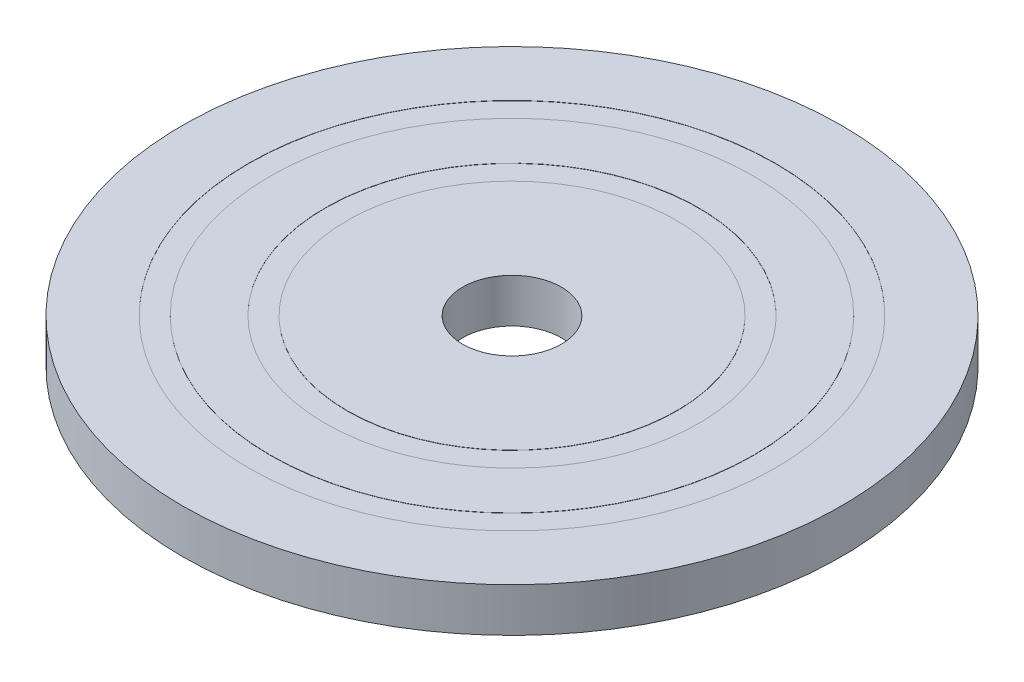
ISO-10303-21;
HEADER;
FILE_DESCRIPTION(('STEP AP214'),'2;1');
FILE_NAME('part.step','',(''),(''),'','','');
FILE_SCHEMA(('AUTOMOTIVE_DESIGN { 1 0 10303 214 1 1 1 1 }'));
ENDSEC;
DATA;
#1=APPLICATION_CONTEXT('core data for automotive mechanical design processes');
#2=APPLICATION_PROTOCOL_DEFINITION('international standard','automotive_design',2000,#1);
#3=PRODUCT_CONTEXT('',#1,'mechanical');
#4=PRODUCT('Part','Part','',(#3));
#5=PRODUCT_RELATED_PRODUCT_CATEGORY('part','',(#4));
#6=PRODUCT_DEFINITION_FORMATION('','',#4);
#7=PRODUCT_DEFINITION_CONTEXT('part definition',#1,'design');
#8=PRODUCT_DEFINITION('design','',#6,#7);
#9=PRODUCT_DEFINITION_SHAPE('','',#8);
#10=(LENGTH_UNIT() NAMED_UNIT(*) SI_UNIT(.MILLI.,.METRE.));
#11=(NAMED_UNIT(*) PLANE_ANGLE_UNIT() SI_UNIT($,.RADIAN.));
#12=(NAMED_UNIT(*) SI_UNIT($,.STERADIAN.) SOLID_ANGLE_UNIT());
#13=UNCERTAINTY_MEASURE_WITH_UNIT(LENGTH_MEASURE(1.E-05),#10,'distance_accuracy_value','');
#14=(GEOMETRIC_REPRESENTATION_CONTEXT(3) GLOBAL_UNCERTAINTY_ASSIGNED_CONTEXT((#13)) GLOBAL_UNIT_ASSIGNED_CONTEXT((#10,
#11,#12)) REPRESENTATION_CONTEXT('',''));
#15=CARTESIAN_POINT('',(0.,0.,0.));
#16=DIRECTION('',(0.,0.,1.));
#17=DIRECTION('',(1.,0.,0.));
#18=AXIS2_PLACEMENT_3D('',#15,#16,#17);
#19=CARTESIAN_POINT('',(0.,2.,0.));
#20=DIRECTION('',(0.,1.,0.));
#21=DIRECTION('',(0.,0.,1.));
#22=AXIS2_PLACEMENT_3D('',#19,#20,#21);
#23=PLANE('',#22);
#24=CARTESIAN_POINT('',(0.,2.,0.));
#25=DIRECTION('',(0.,1.,0.));
#26=DIRECTION('',(0.,0.,1.));
#27=AXIS2_PLACEMENT_3D('',#24,#25,#26);
#28=CIRCLE('',#27,2.25);
#29=CARTESIAN_POINT('',(0.,2.,2.25));
#30=VERTEX_POINT('',#29);
#31=EDGE_CURVE('E46',#30,#30,#28,.T.);
#32=ORIENTED_EDGE('',*,*,#31,.F.);
#33=EDGE_LOOP('',(#32));
#34=FACE_BOUND('',#33,.T.);
#35=CARTESIAN_POINT('',(0.,2.,0.));
#36=DIRECTION('',(0.,1.,0.));
#37=DIRECTION('',(0.,0.,1.));
#38=AXIS2_PLACEMENT_3D('',#35,#36,#37);
#39=CIRCLE('',#38,7.5);
#40=CARTESIAN_POINT('',(0.,2.,7.5));
#41=VERTEX_POINT('',#40);
#42=EDGE_CURVE('E70',#41,#41,#39,.T.);
#43=ORIENTED_EDGE('',*,*,#42,.T.);
#44=EDGE_LOOP('',(#43));
#45=FACE_BOUND('',#44,.T.);
#46=ADVANCED_FACE('F35',(#34,#45),#23,.T.);
#47=CARTESIAN_POINT('',(0.,2.,0.));
#48=DIRECTION('',(0.,1.,0.));
#49=DIRECTION('',(0.,0.,1.));
#50=AXIS2_PLACEMENT_3D('',#47,#48,#49);
#51=CIRCLE('',#50,8.5);
#52=CARTESIAN_POINT('',(0.,2.,8.5));
#53=VERTEX_POINT('',#52);
#54=EDGE_CURVE('E66',#53,#53,#51,.T.);
#55=ORIENTED_EDGE('',*,*,#54,.F.);
#56=EDGE_LOOP('',(#55));
#57=FACE_BOUND('',#56,.T.);
#58=CARTESIAN_POINT('',(0.,2.,0.));
#59=DIRECTION('',(0.,1.,0.));
#60=DIRECTION('',(0.,0.,1.));
#61=AXIS2_PLACEMENT_3D('',#58,#59,#60);
#62=CIRCLE('',#61,11.);
#63=CARTESIAN_POINT('',(0.,2.,11.));
#64=VERTEX_POINT('',#63);
#65=EDGE_CURVE('E58',#64,#64,#62,.T.);
#66=ORIENTED_EDGE('',*,*,#65,.T.);
#67=EDGE_LOOP('',(#66));
#68=FACE_BOUND('',#67,.T.);
#69=ADVANCED_FACE('F93',(#57,#68),#23,.T.);
#70=CARTESIAN_POINT('',(0.,2.,0.));
#71=DIRECTION('',(0.,1.,0.));
#72=DIRECTION('',(0.,0.,1.));
#73=AXIS2_PLACEMENT_3D('',#70,#71,#72);
#74=CIRCLE('',#73,12.);
#75=CARTESIAN_POINT('',(0.,2.,12.));
#76=VERTEX_POINT('',#75);
#77=EDGE_CURVE('E54',#76,#76,#74,.T.);
#78=ORIENTED_EDGE('',*,*,#77,.F.);
#79=EDGE_LOOP('',(#78));
#80=FACE_BOUND('',#79,.T.);
#81=CARTESIAN_POINT('',(0.,2.,0.));
#82=DIRECTION('',(0.,1.,0.));
#83=DIRECTION('',(0.,0.,1.));
#84=AXIS2_PLACEMENT_3D('',#81,#82,#83);
#85=CIRCLE('',#84,15.);
#86=CARTESIAN_POINT('',(0.,2.,15.));
#87=VERTEX_POINT('',#86);
#88=EDGE_CURVE('E11',#87,#87,#85,.T.);
#89=ORIENTED_EDGE('',*,*,#88,.T.);
#90=EDGE_LOOP('',(#89));
#91=FACE_BOUND('',#90,.T.);
#92=ADVANCED_FACE('F96',(#80,#91),#23,.T.);
#93=CARTESIAN_POINT('',(0.,0.,0.));
#94=DIRECTION('',(0.,1.,0.));
#95=DIRECTION('',(0.,0.,1.));
#96=AXIS2_PLACEMENT_3D('',#93,#94,#95);
#97=PLANE('',#96);
#98=CARTESIAN_POINT('',(0.,0.,0.));
#99=DIRECTION('',(0.,1.,0.));
#100=DIRECTION('',(0.,0.,1.));
#101=AXIS2_PLACEMENT_3D('',#98,#99,#100);
#102=CIRCLE('',#101,15.);
#103=CARTESIAN_POINT('',(0.,0.,15.));
#104=VERTEX_POINT('',#103);
#105=EDGE_CURVE('E39',#104,#104,#102,.T.);
#106=ORIENTED_EDGE('',*,*,#105,.F.);
#107=EDGE_LOOP('',(#106));
#108=FACE_BOUND('',#107,.T.);
#109=CARTESIAN_POINT('',(0.,0.,0.));
#110=DIRECTION('',(0.,1.,0.));
#111=DIRECTION('',(0.,0.,1.));
#112=AXIS2_PLACEMENT_3D('',#109,#110,#111);
#113=CIRCLE('',#112,2.25);
#114=CARTESIAN_POINT('',(0.,0.,2.25));
#115=VERTEX_POINT('',#114);
#116=EDGE_CURVE('E48',#115,#115,#113,.T.);
#117=ORIENTED_EDGE('',*,*,#116,.T.);
#118=EDGE_LOOP('',(#117));
#119=FACE_BOUND('',#118,.T.);
#120=ADVANCED_FACE('F122',(#108,#119),#97,.F.);
#121=CARTESIAN_POINT('',(0.,2.,0.));
#122=DIRECTION('',(0.,-1.,0.));
#123=DIRECTION('',(0.,0.,-1.));
#124=AXIS2_PLACEMENT_3D('',#121,#122,#123);
#125=CYLINDRICAL_SURFACE('',#124,15.);
#126=ORIENTED_EDGE('',*,*,#88,.F.);
#127=EDGE_LOOP('',(#126));
#128=FACE_BOUND('',#127,.T.);
#129=ORIENTED_EDGE('',*,*,#105,.T.);
#130=EDGE_LOOP('',(#129));
#131=FACE_BOUND('',#130,.T.);
#132=ADVANCED_FACE('F37',(#128,#131),#125,.T.);
#133=CARTESIAN_POINT('',(0.,2.,0.));
#134=DIRECTION('',(0.,-1.,0.));
#135=DIRECTION('',(0.,0.,-1.));
#136=AXIS2_PLACEMENT_3D('',#133,#134,#135);
#137=CYLINDRICAL_SURFACE('',#136,2.25);
#138=ORIENTED_EDGE('',*,*,#31,.T.);
#139=EDGE_LOOP('',(#138));
#140=FACE_BOUND('',#139,.T.);
#141=ORIENTED_EDGE('',*,*,#116,.F.);
#142=EDGE_LOOP('',(#141));
#143=FACE_BOUND('',#142,.T.);
#144=ADVANCED_FACE('F103',(#140,#143),#137,.F.);
#145=CARTESIAN_POINT('',(0.,1.99,0.));
#146=DIRECTION('',(0.,1.,0.));
#147=DIRECTION('',(0.,0.,1.));
#148=AXIS2_PLACEMENT_3D('',#145,#146,#147);
#149=CYLINDRICAL_SURFACE('',#148,11.);
#150=CARTESIAN_POINT('',(0.,1.99,0.));
#151=DIRECTION('',(0.,1.,0.));
#152=DIRECTION('',(0.,0.,1.));
#153=AXIS2_PLACEMENT_3D('',#150,#151,#152);
#154=CIRCLE('',#153,11.);
#155=CARTESIAN_POINT('',(0.,1.99,11.));
#156=VERTEX_POINT('',#155);
#157=EDGE_CURVE('E57',#156,#156,#154,.T.);
#158=CARTESIAN_POINT('',(0.,1.99,11.));
#159=CARTESIAN_POINT('',(0.,1.99010416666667,11.));
#160=CARTESIAN_POINT('',(0.,1.99020833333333,11.));
#161=CARTESIAN_POINT('',(0.,1.99041666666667,11.));
#162=CARTESIAN_POINT('',(0.,1.99052083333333,11.));
#163=CARTESIAN_POINT('',(0.,1.99072916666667,11.));
#164=CARTESIAN_POINT('',(0.,1.99083333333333,11.));
#165=CARTESIAN_POINT('',(0.,1.99104166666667,11.));
#166=CARTESIAN_POINT('',(0.,1.99114583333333,11.));
#167=CARTESIAN_POINT('',(0.,1.99135416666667,11.));
#168=CARTESIAN_POINT('',(0.,1.99145833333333,11.));
#169=CARTESIAN_POINT('',(0.,1.99166666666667,11.));
#170=CARTESIAN_POINT('',(0.,1.99177083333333,11.));
#171=CARTESIAN_POINT('',(0.,1.99197916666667,11.));
#172=CARTESIAN_POINT('',(0.,1.99208333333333,11.));
#173=CARTESIAN_POINT('',(0.,1.99229166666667,11.));
#174=CARTESIAN_POINT('',(0.,1.99239583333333,11.));
#175=CARTESIAN_POINT('',(0.,1.99260416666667,11.));
#176=CARTESIAN_POINT('',(0.,1.99270833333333,11.));
#177=CARTESIAN_POINT('',(0.,1.99291666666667,11.));
#178=CARTESIAN_POINT('',(0.,1.99302083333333,11.));
#179=CARTESIAN_POINT('',(0.,1.99322916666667,11.));
#180=CARTESIAN_POINT('',(0.,1.99333333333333,11.));
#181=CARTESIAN_POINT('',(0.,1.99354166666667,11.));
#182=CARTESIAN_POINT('',(0.,1.99364583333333,11.));
#183=CARTESIAN_POINT('',(0.,1.99385416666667,11.));
#184=CARTESIAN_POINT('',(0.,1.99395833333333,11.));
#185=CARTESIAN_POINT('',(0.,1.99416666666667,11.));
#186=CARTESIAN_POINT('',(0.,1.99427083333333,11.));
#187=CARTESIAN_POINT('',(0.,1.99447916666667,11.));
#188=CARTESIAN_POINT('',(0.,1.99458333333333,11.));
#189=CARTESIAN_POINT('',(0.,1.99479166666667,11.));
#190=CARTESIAN_POINT('',(0.,1.99489583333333,11.));
#191=CARTESIAN_POINT('',(0.,1.99510416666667,11.));
#192=CARTESIAN_POINT('',(0.,1.99520833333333,11.));
#193=CARTESIAN_POINT('',(0.,1.99541666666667,11.));
#194=CARTESIAN_POINT('',(0.,1.99552083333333,11.));
#195=CARTESIAN_POINT('',(0.,1.99572916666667,11.));
#196=CARTESIAN_POINT('',(0.,1.99583333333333,11.));
#197=CARTESIAN_POINT('',(0.,1.99604166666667,11.));
#198=CARTESIAN_POINT('',(0.,1.99614583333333,11.));
#199=CARTESIAN_POINT('',(0.,1.99635416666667,11.));
#200=CARTESIAN_POINT('',(0.,1.99645833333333,11.));
#201=CARTESIAN_POINT('',(0.,1.99666666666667,11.));
#202=CARTESIAN_POINT('',(0.,1.99677083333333,11.));
#203=CARTESIAN_POINT('',(0.,1.99697916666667,11.));
#204=CARTESIAN_POINT('',(0.,1.99708333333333,11.));
#205=CARTESIAN_POINT('',(0.,1.99729166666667,11.));
#206=CARTESIAN_POINT('',(0.,1.99739583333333,11.));
#207=CARTESIAN_POINT('',(0.,1.99760416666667,11.));
#208=CARTESIAN_POINT('',(0.,1.99770833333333,11.));
#209=CARTESIAN_POINT('',(0.,1.99791666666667,11.));
#210=CARTESIAN_POINT('',(0.,1.99802083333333,11.));
#211=CARTESIAN_POINT('',(0.,1.99822916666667,11.));
#212=CARTESIAN_POINT('',(0.,1.99833333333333,11.));
#213=CARTESIAN_POINT('',(0.,1.99854166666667,11.));
#214=CARTESIAN_POINT('',(0.,1.99864583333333,11.));
#215=CARTESIAN_POINT('',(0.,1.99885416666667,11.));
#216=CARTESIAN_POINT('',(0.,1.99895833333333,11.));
#217=CARTESIAN_POINT('',(0.,1.99916666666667,11.));
#218=CARTESIAN_POINT('',(0.,1.99927083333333,11.));
#219=CARTESIAN_POINT('',(0.,1.99947916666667,11.));
#220=CARTESIAN_POINT('',(0.,1.99958333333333,11.));
#221=CARTESIAN_POINT('',(0.,1.99979166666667,11.));
#222=CARTESIAN_POINT('',(0.,1.99989583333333,11.));
#223=CARTESIAN_POINT('',(0.,2.,11.));
#224=B_SPLINE_CURVE_WITH_KNOTS('',3,(#158,#159,#160,#161,#162,#163,#164,#165,#166,#167,#168,
#169,#170,#171,#172,#173,#174,#175,#176,#177,#178,#179,#180,#181,#182,#183,#184,#185,#186,#187,
#188,#189,#190,#191,#192,#193,#194,#195,#196,#197,#198,#199,#200,#201,#202,#203,#204,#205,#206,
#207,#208,#209,#210,#211,#212,#213,#214,#215,#216,#217,#218,#219,#220,#221,#222,#223),
.UNSPECIFIED.,.F.,.F.,(4,2,2,2,2,2,2,2,2,2,2,2,2,2,2,2,2,2,2,2,2,2,2,2,2,2,2,2,2,2,2,2,4),(0.,
0.000312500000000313,0.000625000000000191,0.00093750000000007,0.00125000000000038,
0.00156250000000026,0.00187500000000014,0.00218750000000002,0.00250000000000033,
0.00281250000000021,0.00312500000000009,0.0034375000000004,0.00375000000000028,
0.00406250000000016,0.00437500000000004,0.00468750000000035,0.00500000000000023,
0.00531250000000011,0.00562500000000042,0.0059375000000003,0.00625000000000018,
0.00656250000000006,0.00687500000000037,0.00718750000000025,0.00750000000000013,
0.00781250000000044,0.00812500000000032,0.0084375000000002,0.00875000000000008,
0.00906250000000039,0.00937500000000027,0.00968750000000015,0.01),.UNSPECIFIED.);
#225=EDGE_CURVE('BSEAM100',#156,#64,#224,.T.);
#226=ORIENTED_EDGE('',*,*,#157,.T.);
#227=ORIENTED_EDGE('',*,*,#65,.F.);
#228=ORIENTED_EDGE('',*,*,#225,.T.);
#229=ORIENTED_EDGE('',*,*,#225,.F.);
#230=EDGE_LOOP('',(#226,#228,#227,#229));
#231=FACE_BOUND('',#230,.T.);
#232=ADVANCED_FACE('F100',(#231),#149,.T.);
#233=CARTESIAN_POINT('',(0.,1.99,0.));
#234=DIRECTION('',(0.,1.,0.));
#235=DIRECTION('',(0.,0.,1.));
#236=AXIS2_PLACEMENT_3D('',#233,#234,#235);
#237=CYLINDRICAL_SURFACE('',#236,12.);
#238=CARTESIAN_POINT('',(0.,1.99,0.));
#239=DIRECTION('',(0.,1.,0.));
#240=DIRECTION('',(0.,0.,1.));
#241=AXIS2_PLACEMENT_3D('',#238,#239,#240);
#242=CIRCLE('',#241,12.);
#243=CARTESIAN_POINT('',(0.,1.99,12.));
#244=VERTEX_POINT('',#243);
#245=EDGE_CURVE('E51',#244,#244,#242,.T.);
#246=CARTESIAN_POINT('',(0.,1.99,12.));
#247=CARTESIAN_POINT('',(0.,1.99010416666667,12.));
#248=CARTESIAN_POINT('',(0.,1.99020833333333,12.));
#249=CARTESIAN_POINT('',(0.,1.99041666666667,12.));
#250=CARTESIAN_POINT('',(0.,1.99052083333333,12.));
#251=CARTESIAN_POINT('',(0.,1.99072916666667,12.));
#252=CARTESIAN_POINT('',(0.,1.99083333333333,12.));
#253=CARTESIAN_POINT('',(0.,1.99104166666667,12.));
#254=CARTESIAN_POINT('',(0.,1.99114583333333,12.));
#255=CARTESIAN_POINT('',(0.,1.99135416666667,12.));
#256=CARTESIAN_POINT('',(0.,1.99145833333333,12.));
#257=CARTESIAN_POINT('',(0.,1.99166666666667,12.));
#258=CARTESIAN_POINT('',(0.,1.99177083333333,12.));
#259=CARTESIAN_POINT('',(0.,1.99197916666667,12.));
#260=CARTESIAN_POINT('',(0.,1.99208333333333,12.));
#261=CARTESIAN_POINT('',(0.,1.99229166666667,12.));
#262=CARTESIAN_POINT('',(0.,1.99239583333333,12.));
#263=CARTESIAN_POINT('',(0.,1.99260416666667,12.));
#264=CARTESIAN_POINT('',(0.,1.99270833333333,12.));
#265=CARTESIAN_POINT('',(0.,1.99291666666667,12.));
#266=CARTESIAN_POINT('',(0.,1.99302083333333,12.));
#267=CARTESIAN_POINT('',(0.,1.99322916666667,12.));
#268=CARTESIAN_POINT('',(0.,1.99333333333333,12.));
#269=CARTESIAN_POINT('',(0.,1.99354166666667,12.));
#270=CARTESIAN_POINT('',(0.,1.99364583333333,12.));
#271=CARTESIAN_POINT('',(0.,1.99385416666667,12.));
#272=CARTESIAN_POINT('',(0.,1.99395833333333,12.));
#273=CARTESIAN_POINT('',(0.,1.99416666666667,12.));
#274=CARTESIAN_POINT('',(0.,1.99427083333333,12.));
#275=CARTESIAN_POINT('',(0.,1.99447916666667,12.));
#276=CARTESIAN_POINT('',(0.,1.99458333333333,12.));
#277=CARTESIAN_POINT('',(0.,1.99479166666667,12.));
#278=CARTESIAN_POINT('',(0.,1.99489583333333,12.));
#279=CARTESIAN_POINT('',(0.,1.99510416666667,12.));
#280=CARTESIAN_POINT('',(0.,1.99520833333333,12.));
#281=CARTESIAN_POINT('',(0.,1.99541666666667,12.));
#282=CARTESIAN_POINT('',(0.,1.99552083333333,12.));
#283=CARTESIAN_POINT('',(0.,1.99572916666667,12.));
#284=CARTESIAN_POINT('',(0.,1.99583333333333,12.));
#285=CARTESIAN_POINT('',(0.,1.99604166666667,12.));
#286=CARTESIAN_POINT('',(0.,1.99614583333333,12.));
#287=CARTESIAN_POINT('',(0.,1.99635416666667,12.));
#288=CARTESIAN_POINT('',(0.,1.99645833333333,12.));
#289=CARTESIAN_POINT('',(0.,1.99666666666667,12.));
#290=CARTESIAN_POINT('',(0.,1.99677083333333,12.));
#291=CARTESIAN_POINT('',(0.,1.99697916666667,12.));
#292=CARTESIAN_POINT('',(0.,1.99708333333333,12.));
#293=CARTESIAN_POINT('',(0.,1.99729166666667,12.));
#294=CARTESIAN_POINT('',(0.,1.99739583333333,12.));
#295=CARTESIAN_POINT('',(0.,1.99760416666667,12.));
#296=CARTESIAN_POINT('',(0.,1.99770833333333,12.));
#297=CARTESIAN_POINT('',(0.,1.99791666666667,12.));
#298=CARTESIAN_POINT('',(0.,1.99802083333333,12.));
#299=CARTESIAN_POINT('',(0.,1.99822916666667,12.));
#300=CARTESIAN_POINT('',(0.,1.99833333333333,12.));
#301=CARTESIAN_POINT('',(0.,1.99854166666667,12.));
#302=CARTESIAN_POINT('',(0.,1.99864583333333,12.));
#303=CARTESIAN_POINT('',(0.,1.99885416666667,12.));
#304=CARTESIAN_POINT('',(0.,1.99895833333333,12.));
#305=CARTESIAN_POINT('',(0.,1.99916666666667,12.));
#306=CARTESIAN_POINT('',(0.,1.99927083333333,12.));
#307=CARTESIAN_POINT('',(0.,1.99947916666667,12.));
#308=CARTESIAN_POINT('',(0.,1.99958333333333,12.));
#309=CARTESIAN_POINT('',(0.,1.99979166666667,12.));
#310=CARTESIAN_POINT('',(0.,1.99989583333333,12.));
#311=CARTESIAN_POINT('',(0.,2.,12.));
#312=B_SPLINE_CURVE_WITH_KNOTS('',3,(#246,#247,#248,#249,#250,#251,#252,#253,#254,#255,#256,
#257,#258,#259,#260,#261,#262,#263,#264,#265,#266,#267,#268,#269,#270,#271,#272,#273,#274,#275,
#276,#277,#278,#279,#280,#281,#282,#283,#284,#285,#286,#287,#288,#289,#290,#291,#292,#293,#294,
#295,#296,#297,#298,#299,#300,#301,#302,#303,#304,#305,#306,#307,#308,#309,#310,#311),
.UNSPECIFIED.,.F.,.F.,(4,2,2,2,2,2,2,2,2,2,2,2,2,2,2,2,2,2,2,2,2,2,2,2,2,2,2,2,2,2,2,2,4),(0.,
0.000312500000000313,0.000625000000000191,0.00093750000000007,0.00125000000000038,
0.00156250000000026,0.00187500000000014,0.00218750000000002,0.00250000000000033,
0.00281250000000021,0.00312500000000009,0.0034375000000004,0.00375000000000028,
0.00406250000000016,0.00437500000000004,0.00468750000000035,0.00500000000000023,
0.00531250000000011,0.00562500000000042,0.0059375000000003,0.00625000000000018,
0.00656250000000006,0.00687500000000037,0.00718750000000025,0.00750000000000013,
0.00781250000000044,0.00812500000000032,0.0084375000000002,0.00875000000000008,
0.00906250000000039,0.00937500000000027,0.00968750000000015,0.01),.UNSPECIFIED.);
#313=EDGE_CURVE('BSEAM102',#244,#76,#312,.T.);
#314=ORIENTED_EDGE('',*,*,#245,.F.);
#315=ORIENTED_EDGE('',*,*,#77,.T.);
#316=ORIENTED_EDGE('',*,*,#313,.T.);
#317=ORIENTED_EDGE('',*,*,#313,.F.);
#318=EDGE_LOOP('',(#314,#316,#315,#317));
#319=FACE_BOUND('',#318,.T.);
#320=ADVANCED_FACE('F102',(#319),#237,.F.);
#321=CARTESIAN_POINT('',(-33.1414213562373,1.99,0.));
#322=DIRECTION('',(0.,1.,0.));
#323=DIRECTION('',(0.,0.,1.));
#324=AXIS2_PLACEMENT_3D('',#321,#322,#323);
#325=PLANE('',#324);
#326=ORIENTED_EDGE('',*,*,#157,.F.);
#327=EDGE_LOOP('',(#326));
#328=FACE_BOUND('',#327,.T.);
#329=ORIENTED_EDGE('',*,*,#245,.T.);
#330=EDGE_LOOP('',(#329));
#331=FACE_BOUND('',#330,.T.);
#332=ADVANCED_FACE('F110',(#328,#331),#325,.T.);
#333=CARTESIAN_POINT('',(0.,1.99,0.));
#334=DIRECTION('',(0.,1.,0.));
#335=DIRECTION('',(0.,0.,1.));
#336=AXIS2_PLACEMENT_3D('',#333,#334,#335);
#337=CYLINDRICAL_SURFACE('',#336,7.5);
#338=CARTESIAN_POINT('',(0.,1.99,0.));
#339=DIRECTION('',(0.,1.,0.));
#340=DIRECTION('',(0.,0.,1.));
#341=AXIS2_PLACEMENT_3D('',#338,#339,#340);
#342=CIRCLE('',#341,7.5);
#343=CARTESIAN_POINT('',(0.,1.99,7.5));
#344=VERTEX_POINT('',#343);
#345=EDGE_CURVE('E69',#344,#344,#342,.T.);
#346=CARTESIAN_POINT('',(0.,1.99,7.5));
#347=CARTESIAN_POINT('',(0.,1.99010416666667,7.5));
#348=CARTESIAN_POINT('',(0.,1.99020833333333,7.5));
#349=CARTESIAN_POINT('',(0.,1.99041666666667,7.5));
#350=CARTESIAN_POINT('',(0.,1.99052083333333,7.5));
#351=CARTESIAN_POINT('',(0.,1.99072916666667,7.5));
#352=CARTESIAN_POINT('',(0.,1.99083333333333,7.5));
#353=CARTESIAN_POINT('',(0.,1.99104166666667,7.5));
#354=CARTESIAN_POINT('',(0.,1.99114583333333,7.5));
#355=CARTESIAN_POINT('',(0.,1.99135416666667,7.5));
#356=CARTESIAN_POINT('',(0.,1.99145833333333,7.5));
#357=CARTESIAN_POINT('',(0.,1.99166666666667,7.5));
#358=CARTESIAN_POINT('',(0.,1.99177083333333,7.5));
#359=CARTESIAN_POINT('',(0.,1.99197916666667,7.5));
#360=CARTESIAN_POINT('',(0.,1.99208333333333,7.5));
#361=CARTESIAN_POINT('',(0.,1.99229166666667,7.5));
#362=CARTESIAN_POINT('',(0.,1.99239583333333,7.5));
#363=CARTESIAN_POINT('',(0.,1.99260416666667,7.5));
#364=CARTESIAN_POINT('',(0.,1.99270833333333,7.5));
#365=CARTESIAN_POINT('',(0.,1.99291666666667,7.5));
#366=CARTESIAN_POINT('',(0.,1.99302083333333,7.5));
#367=CARTESIAN_POINT('',(0.,1.99322916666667,7.5));
#368=CARTESIAN_POINT('',(0.,1.99333333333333,7.5));
#369=CARTESIAN_POINT('',(0.,1.99354166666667,7.5));
#370=CARTESIAN_POINT('',(0.,1.99364583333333,7.5));
#371=CARTESIAN_POINT('',(0.,1.99385416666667,7.5));
#372=CARTESIAN_POINT('',(0.,1.99395833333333,7.5));
#373=CARTESIAN_POINT('',(0.,1.99416666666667,7.5));
#374=CARTESIAN_POINT('',(0.,1.99427083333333,7.5));
#375=CARTESIAN_POINT('',(0.,1.99447916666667,7.5));
#376=CARTESIAN_POINT('',(0.,1.99458333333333,7.5));
#377=CARTESIAN_POINT('',(0.,1.99479166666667,7.5));
#378=CARTESIAN_POINT('',(0.,1.99489583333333,7.5));
#379=CARTESIAN_POINT('',(0.,1.99510416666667,7.5));
#380=CARTESIAN_POINT('',(0.,1.99520833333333,7.5));
#381=CARTESIAN_POINT('',(0.,1.99541666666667,7.5));
#382=CARTESIAN_POINT('',(0.,1.99552083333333,7.5));
#383=CARTESIAN_POINT('',(0.,1.99572916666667,7.5));
#384=CARTESIAN_POINT('',(0.,1.99583333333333,7.5));
#385=CARTESIAN_POINT('',(0.,1.99604166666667,7.5));
#386=CARTESIAN_POINT('',(0.,1.99614583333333,7.5));
#387=CARTESIAN_POINT('',(0.,1.99635416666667,7.5));
#388=CARTESIAN_POINT('',(0.,1.99645833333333,7.5));
#389=CARTESIAN_POINT('',(0.,1.99666666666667,7.5));
#390=CARTESIAN_POINT('',(0.,1.99677083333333,7.5));
#391=CARTESIAN_POINT('',(0.,1.99697916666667,7.5));
#392=CARTESIAN_POINT('',(0.,1.99708333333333,7.5));
#393=CARTESIAN_POINT('',(0.,1.99729166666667,7.5));
#394=CARTESIAN_POINT('',(0.,1.99739583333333,7.5));
#395=CARTESIAN_POINT('',(0.,1.99760416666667,7.5));
#396=CARTESIAN_POINT('',(0.,1.99770833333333,7.5));
#397=CARTESIAN_POINT('',(0.,1.99791666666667,7.5));
#398=CARTESIAN_POINT('',(0.,1.99802083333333,7.5));
#399=CARTESIAN_POINT('',(0.,1.99822916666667,7.5));
#400=CARTESIAN_POINT('',(0.,1.99833333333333,7.5));
#401=CARTESIAN_POINT('',(0.,1.99854166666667,7.5));
#402=CARTESIAN_POINT('',(0.,1.99864583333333,7.5));
#403=CARTESIAN_POINT('',(0.,1.99885416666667,7.5));
#404=CARTESIAN_POINT('',(0.,1.99895833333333,7.5));
#405=CARTESIAN_POINT('',(0.,1.99916666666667,7.5));
#406=CARTESIAN_POINT('',(0.,1.99927083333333,7.5));
#407=CARTESIAN_POINT('',(0.,1.99947916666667,7.5));
#408=CARTESIAN_POINT('',(0.,1.99958333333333,7.5));
#409=CARTESIAN_POINT('',(0.,1.99979166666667,7.5));
#410=CARTESIAN_POINT('',(0.,1.99989583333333,7.5));
#411=CARTESIAN_POINT('',(0.,2.,7.5));
#412=B_SPLINE_CURVE_WITH_KNOTS('',3,(#346,#347,#348,#349,#350,#351,#352,#353,#354,#355,#356,
#357,#358,#359,#360,#361,#362,#363,#364,#365,#366,#367,#368,#369,#370,#371,#372,#373,#374,#375,
#376,#377,#378,#379,#380,#381,#382,#383,#384,#385,#386,#387,#388,#389,#390,#391,#392,#393,#394,
#395,#396,#397,#398,#399,#400,#401,#402,#403,#404,#405,#406,#407,#408,#409,#410,#411),
.UNSPECIFIED.,.F.,.F.,(4,2,2,2,2,2,2,2,2,2,2,2,2,2,2,2,2,2,2,2,2,2,2,2,2,2,2,2,2,2,2,2,4),(0.,
0.000312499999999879,0.000624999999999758,0.000937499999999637,0.00124999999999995,
0.00156249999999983,0.00187499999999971,0.00218749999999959,0.0024999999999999,
0.00281249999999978,0.00312499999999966,0.00343749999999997,0.00374999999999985,
0.00406249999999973,0.0043749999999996,0.00468749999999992,0.0049999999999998,
0.00531249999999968,0.00562499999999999,0.00593749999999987,0.00624999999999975,
0.00656249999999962,0.00687499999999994,0.00718749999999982,0.00749999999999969,
0.00781250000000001,0.00812499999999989,0.00843749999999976,0.00874999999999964,
0.00906249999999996,0.00937499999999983,0.00968749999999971,0.00999999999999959),.UNSPECIFIED.);
#413=EDGE_CURVE('BSEAM78',#344,#41,#412,.T.);
#414=ORIENTED_EDGE('',*,*,#345,.T.);
#415=ORIENTED_EDGE('',*,*,#42,.F.);
#416=ORIENTED_EDGE('',*,*,#413,.T.);
#417=ORIENTED_EDGE('',*,*,#413,.F.);
#418=EDGE_LOOP('',(#414,#416,#415,#417));
#419=FACE_BOUND('',#418,.T.);
#420=ADVANCED_FACE('F78',(#419),#337,.T.);
#421=CARTESIAN_POINT('',(0.,1.99,0.));
#422=DIRECTION('',(0.,1.,0.));
#423=DIRECTION('',(0.,0.,1.));
#424=AXIS2_PLACEMENT_3D('',#421,#422,#423);
#425=CYLINDRICAL_SURFACE('',#424,8.5);
#426=CARTESIAN_POINT('',(0.,1.99,0.));
#427=DIRECTION('',(0.,1.,0.));
#428=DIRECTION('',(0.,0.,1.));
#429=AXIS2_PLACEMENT_3D('',#426,#427,#428);
#430=CIRCLE('',#429,8.5);
#431=CARTESIAN_POINT('',(0.,1.99,8.5));
#432=VERTEX_POINT('',#431);
#433=EDGE_CURVE('E61',#432,#432,#430,.T.);
#434=CARTESIAN_POINT('',(0.,1.99,8.5));
#435=CARTESIAN_POINT('',(0.,1.99010416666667,8.5));
#436=CARTESIAN_POINT('',(0.,1.99020833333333,8.5));
#437=CARTESIAN_POINT('',(0.,1.99041666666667,8.5));
#438=CARTESIAN_POINT('',(0.,1.99052083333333,8.5));
#439=CARTESIAN_POINT('',(0.,1.99072916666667,8.5));
#440=CARTESIAN_POINT('',(0.,1.99083333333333,8.5));
#441=CARTESIAN_POINT('',(0.,1.99104166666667,8.5));
#442=CARTESIAN_POINT('',(0.,1.99114583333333,8.5));
#443=CARTESIAN_POINT('',(0.,1.99135416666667,8.5));
#444=CARTESIAN_POINT('',(0.,1.99145833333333,8.5));
#445=CARTESIAN_POINT('',(0.,1.99166666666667,8.5));
#446=CARTESIAN_POINT('',(0.,1.99177083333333,8.5));
#447=CARTESIAN_POINT('',(0.,1.99197916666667,8.5));
#448=CARTESIAN_POINT('',(0.,1.99208333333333,8.5));
#449=CARTESIAN_POINT('',(0.,1.99229166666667,8.5));
#450=CARTESIAN_POINT('',(0.,1.99239583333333,8.5));
#451=CARTESIAN_POINT('',(0.,1.99260416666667,8.5));
#452=CARTESIAN_POINT('',(0.,1.99270833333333,8.5));
#453=CARTESIAN_POINT('',(0.,1.99291666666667,8.5));
#454=CARTESIAN_POINT('',(0.,1.99302083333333,8.5));
#455=CARTESIAN_POINT('',(0.,1.99322916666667,8.5));
#456=CARTESIAN_POINT('',(0.,1.99333333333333,8.5));
#457=CARTESIAN_POINT('',(0.,1.99354166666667,8.5));
#458=CARTESIAN_POINT('',(0.,1.99364583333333,8.5));
#459=CARTESIAN_POINT('',(0.,1.99385416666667,8.5));
#460=CARTESIAN_POINT('',(0.,1.99395833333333,8.5));
#461=CARTESIAN_POINT('',(0.,1.99416666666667,8.5));
#462=CARTESIAN_POINT('',(0.,1.99427083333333,8.5));
#463=CARTESIAN_POINT('',(0.,1.99447916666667,8.5));
#464=CARTESIAN_POINT('',(0.,1.99458333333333,8.5));
#465=CARTESIAN_POINT('',(0.,1.99479166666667,8.5));
#466=CARTESIAN_POINT('',(0.,1.99489583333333,8.5));
#467=CARTESIAN_POINT('',(0.,1.99510416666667,8.5));
#468=CARTESIAN_POINT('',(0.,1.99520833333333,8.5));
#469=CARTESIAN_POINT('',(0.,1.99541666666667,8.5));
#470=CARTESIAN_POINT('',(0.,1.99552083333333,8.5));
#471=CARTESIAN_POINT('',(0.,1.99572916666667,8.5));
#472=CARTESIAN_POINT('',(0.,1.99583333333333,8.5));
#473=CARTESIAN_POINT('',(0.,1.99604166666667,8.5));
#474=CARTESIAN_POINT('',(0.,1.99614583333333,8.5));
#475=CARTESIAN_POINT('',(0.,1.99635416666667,8.5));
#476=CARTESIAN_POINT('',(0.,1.99645833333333,8.5));
#477=CARTESIAN_POINT('',(0.,1.99666666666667,8.5));
#478=CARTESIAN_POINT('',(0.,1.99677083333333,8.5));
#479=CARTESIAN_POINT('',(0.,1.99697916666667,8.5));
#480=CARTESIAN_POINT('',(0.,1.99708333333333,8.5));
#481=CARTESIAN_POINT('',(0.,1.99729166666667,8.5));
#482=CARTESIAN_POINT('',(0.,1.99739583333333,8.5));
#483=CARTESIAN_POINT('',(0.,1.99760416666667,8.5));
#484=CARTESIAN_POINT('',(0.,1.99770833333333,8.5));
#485=CARTESIAN_POINT('',(0.,1.99791666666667,8.5));
#486=CARTESIAN_POINT('',(0.,1.99802083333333,8.5));
#487=CARTESIAN_POINT('',(0.,1.99822916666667,8.5));
#488=CARTESIAN_POINT('',(0.,1.99833333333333,8.5));
#489=CARTESIAN_POINT('',(0.,1.99854166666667,8.5));
#490=CARTESIAN_POINT('',(0.,1.99864583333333,8.5));
#491=CARTESIAN_POINT('',(0.,1.99885416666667,8.5));
#492=CARTESIAN_POINT('',(0.,1.99895833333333,8.5));
#493=CARTESIAN_POINT('',(0.,1.99916666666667,8.5));
#494=CARTESIAN_POINT('',(0.,1.99927083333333,8.5));
#495=CARTESIAN_POINT('',(0.,1.99947916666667,8.5));
#496=CARTESIAN_POINT('',(0.,1.99958333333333,8.5));
#497=CARTESIAN_POINT('',(0.,1.99979166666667,8.5));
#498=CARTESIAN_POINT('',(0.,1.99989583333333,8.5));
#499=CARTESIAN_POINT('',(0.,2.,8.5));
#500=B_SPLINE_CURVE_WITH_KNOTS('',3,(#434,#435,#436,#437,#438,#439,#440,#441,#442,#443,#444,
#445,#446,#447,#448,#449,#450,#451,#452,#453,#454,#455,#456,#457,#458,#459,#460,#461,#462,#463,
#464,#465,#466,#467,#468,#469,#470,#471,#472,#473,#474,#475,#476,#477,#478,#479,#480,#481,#482,
#483,#484,#485,#486,#487,#488,#489,#490,#491,#492,#493,#494,#495,#496,#497,#498,#499),
.UNSPECIFIED.,.F.,.F.,(4,2,2,2,2,2,2,2,2,2,2,2,2,2,2,2,2,2,2,2,2,2,2,2,2,2,2,2,2,2,2,2,4),(0.,
0.000312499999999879,0.000624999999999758,0.000937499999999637,0.00124999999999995,
0.00156249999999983,0.00187499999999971,0.00218749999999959,0.0024999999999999,
0.00281249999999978,0.00312499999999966,0.00343749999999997,0.00374999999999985,
0.00406249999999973,0.0043749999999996,0.00468749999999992,0.0049999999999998,
0.00531249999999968,0.00562499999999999,0.00593749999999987,0.00624999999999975,
0.00656249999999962,0.00687499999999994,0.00718749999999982,0.00749999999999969,
0.00781250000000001,0.00812499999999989,0.00843749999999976,0.00874999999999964,
0.00906249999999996,0.00937499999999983,0.00968749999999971,0.00999999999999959),.UNSPECIFIED.);
#501=EDGE_CURVE('BSEAM84',#432,#53,#500,.T.);
#502=ORIENTED_EDGE('',*,*,#433,.F.);
#503=ORIENTED_EDGE('',*,*,#54,.T.);
#504=ORIENTED_EDGE('',*,*,#501,.T.);
#505=ORIENTED_EDGE('',*,*,#501,.F.);
#506=EDGE_LOOP('',(#502,#504,#503,#505));
#507=FACE_BOUND('',#506,.T.);
#508=ADVANCED_FACE('F84',(#507),#425,.F.);
#509=CARTESIAN_POINT('',(-33.1414213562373,1.99,0.));
#510=DIRECTION('',(0.,1.,0.));
#511=DIRECTION('',(0.,0.,1.));
#512=AXIS2_PLACEMENT_3D('',#509,#510,#511);
#513=PLANE('',#512);
#514=ORIENTED_EDGE('',*,*,#345,.F.);
#515=EDGE_LOOP('',(#514));
#516=FACE_BOUND('',#515,.T.);
#517=ORIENTED_EDGE('',*,*,#433,.T.);
#518=EDGE_LOOP('',(#517));
#519=FACE_BOUND('',#518,.T.);
#520=ADVANCED_FACE('F81',(#516,#519),#513,.T.);
#521=CLOSED_SHELL('',(#46,#69,#92,#120,#132,#144,#232,#320,#332,#420,#508,#520));
#522=MANIFOLD_SOLID_BREP('B2',#521);
#523=ADVANCED_BREP_SHAPE_REPRESENTATION('',(#18,#522),#14);
#524=SHAPE_DEFINITION_REPRESENTATION(#9,#523);
ENDSEC;
END-ISO-10303-21;
